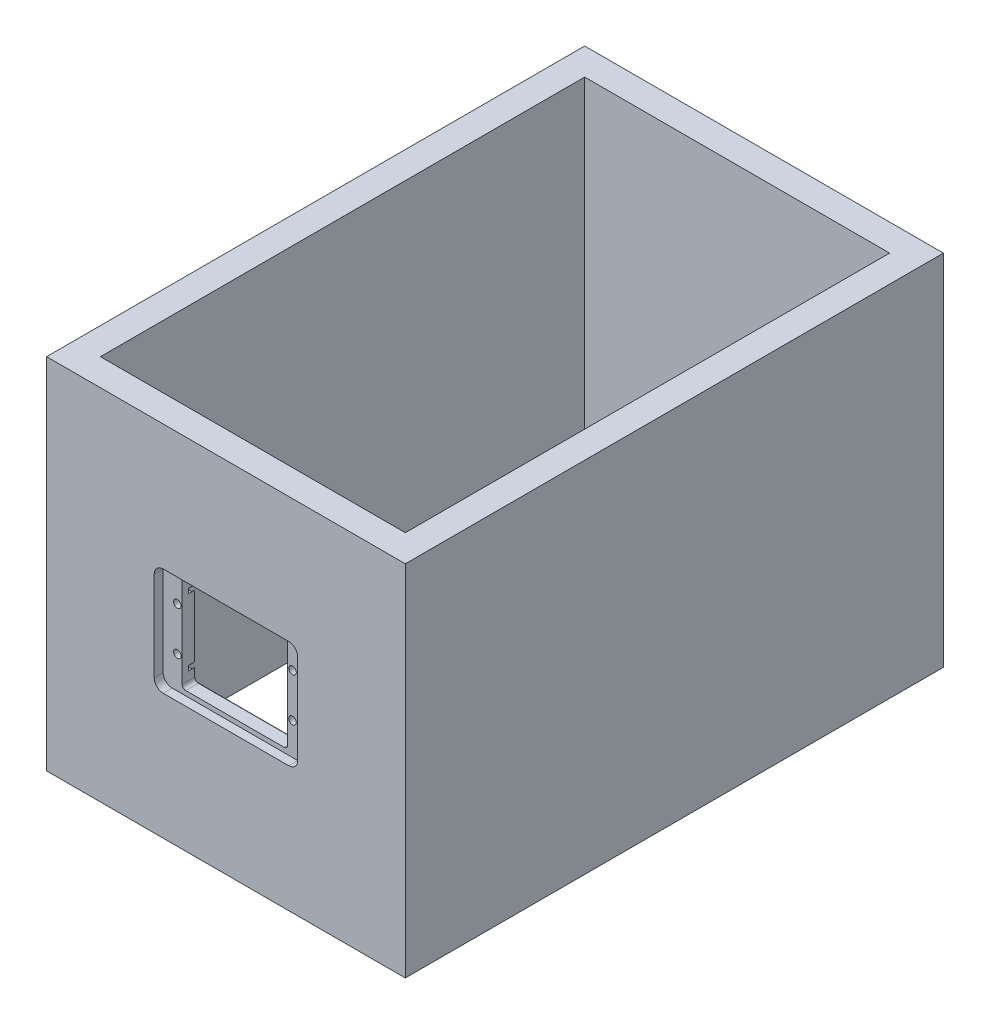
from build123d import *

# Parameters (mm, degrees)
SKETCH_1_W          = 200
SKETCH_1_H          = 200
EXTRUDE_1_DEPTH     = 300
SKETCH_2_W          = 170
SKETCH_2_H          = 270
CUT_EXTRUDE_1_DEPTH = 375.165738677
CUT_EXTRUDE_2_REACH = 333.662
SKETCH_3_R          = 7.5
CUT_EXTRUDE_3_REACH = 320.159
SKETCH_4_R          = 2.1
CUT_EXTRUDE_4_DEPTH = 5
CUT_EXTRUDE_5_DEPTH = 3
SKETCH_7_R          = 3
CUT_EXTRUDE_6_DEPTH = 3.5


with BuildPart() as part:
    # Sketch 1 → Extrude 1 (new body)
    with BuildSketch(Plane.XY):
        Rectangle(SKETCH_1_W, SKETCH_1_H)
    extrude(amount=EXTRUDE_1_DEPTH)

    # Sketch 2 → Cut-Extrude 1 (cut, through all)
    with BuildSketch(Plane.XZ.offset(100)):
        with Locations((0, 150)):
            Rectangle(SKETCH_2_W, SKETCH_2_H)
    extrude(amount=-CUT_EXTRUDE_1_DEPTH, mode=Mode.SUBTRACT)

    # Sketch 3 → Cut-Extrude 2 (cut, up to next)
    with BuildSketch(Plane(origin=(0, 0, 0), x_dir=(-1, 0, 0), z_dir=(0, 0, -1)), mode=Mode.PRIVATE) as cut_extrude_2_sk1:
        Circle(SKETCH_3_R)
    cut_extrude_2_tool1 = extrude(cut_extrude_2_sk1.sketch, amount=-CUT_EXTRUDE_2_REACH, mode=Mode.PRIVATE) & part.part
    add(cut_extrude_2_tool1.solids().sort_by_distance((0, 0, 0))[0], mode=Mode.SUBTRACT)

    # Sketch 4 → Cut-Extrude 3 (cut, up to next)
    with BuildSketch(Plane(origin=(0, 0, 285), x_dir=(-1, 0, 0), z_dir=(0, 0, -1)), mode=Mode.PRIVATE) as cut_extrude_3_sk1:
        with Locations((-32.1, 12.1)):
            Circle(SKETCH_4_R)
    cut_extrude_3_tool1 = extrude(cut_extrude_3_sk1.sketch, amount=-CUT_EXTRUDE_3_REACH, mode=Mode.PRIVATE) & part.part
    # Sketch 4 → Cut-Extrude 3 (cut, up to next)
    with BuildSketch(Plane(origin=(0, 0, 285), x_dir=(-1, 0, 0), z_dir=(0, 0, -1)), mode=Mode.PRIVATE) as cut_extrude_3_sk2:
        with Locations((32.1, 12.1)):
            Circle(SKETCH_4_R)
    cut_extrude_3_tool2 = extrude(cut_extrude_3_sk2.sketch, amount=-CUT_EXTRUDE_3_REACH, mode=Mode.PRIVATE) & part.part
    # Sketch 4 → Cut-Extrude 3 (cut, up to next)
    with BuildSketch(Plane(origin=(0, 0, 285), x_dir=(-1, 0, 0), z_dir=(0, 0, -1)), mode=Mode.PRIVATE) as cut_extrude_3_sk3:
        with Locations((32.1, -12.1)):
            Circle(SKETCH_4_R)
    cut_extrude_3_tool3 = extrude(cut_extrude_3_sk3.sketch, amount=-CUT_EXTRUDE_3_REACH, mode=Mode.PRIVATE) & part.part
    # Sketch 4 → Cut-Extrude 3 (cut, up to next)
    with BuildSketch(Plane(origin=(0, 0, 285), x_dir=(-1, 0, 0), z_dir=(0, 0, -1)), mode=Mode.PRIVATE) as cut_extrude_3_sk4:
        with Locations((-32.1, -12.1)):
            Circle(SKETCH_4_R)
    cut_extrude_3_tool4 = extrude(cut_extrude_3_sk4.sketch, amount=-CUT_EXTRUDE_3_REACH, mode=Mode.PRIVATE) & part.part
    # Sketch 4 → Cut-Extrude 3 (cut, up to next)
    with BuildSketch(Plane(origin=(0, 0, 285), x_dir=(-1, 0, 0), z_dir=(0, 0, -1)), mode=Mode.PRIVATE) as cut_extrude_3_sk5:
        with BuildLine():
            Line((27.4, 27.4), (-27.4, 27.4))
            ThreePointArc((-27.4, 27.4), (-28.814213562, 26.814213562), (-29.4, 25.4))
            Line((-29.4, 25.4), (-29.4, -25.4))
            ThreePointArc((-29.4, -25.4), (-28.814213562, -26.814213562), (-27.4, -27.4))
            Line((-27.4, -27.4), (27.4, -27.4))
            ThreePointArc((27.4, -27.4), (28.814213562, -26.814213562), (29.4, -25.4))
            Line((29.4, -25.4), (29.4, 25.4))
            ThreePointArc((29.4, 25.4), (28.814213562, 26.814213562), (27.4, 27.4))
        make_face()
    cut_extrude_3_tool5 = extrude(cut_extrude_3_sk5.sketch, amount=-CUT_EXTRUDE_3_REACH, mode=Mode.PRIVATE) & part.part
    add(cut_extrude_3_tool1.solids().sort_by_distance((32.1, 12.1, 285))[0], mode=Mode.SUBTRACT)
    add(cut_extrude_3_tool2.solids().sort_by_distance((-32.1, 12.1, 285))[0], mode=Mode.SUBTRACT)
    add(cut_extrude_3_tool3.solids().sort_by_distance((-32.1, -12.1, 285))[0], mode=Mode.SUBTRACT)
    add(cut_extrude_3_tool4.solids().sort_by_distance((32.1, -12.1, 285))[0], mode=Mode.SUBTRACT)
    add(cut_extrude_3_tool5.solids().sort_by_distance((0, 0, 285))[0], mode=Mode.SUBTRACT)

    # Sketch 5 → Cut-Extrude 4 (cut)
    with BuildSketch(Plane.XY.offset(300)):
        with BuildLine():
            Line((-35, 30), (35, 30))
            ThreePointArc((35, 30), (38.535533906, 28.535533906), (40, 25))
            Line((40, 25), (40, -25))
            ThreePointArc((40, -25), (38.535533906, -28.535533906), (35, -30))
            Line((35, -30), (-35, -30))
            ThreePointArc((-35, -30), (-38.535533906, -28.535533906), (-40, -25))
            Line((-40, -25), (-40, 25))
            ThreePointArc((-40, 25), (-38.535533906, 28.535533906), (-35, 30))
        make_face()
    extrude(amount=-CUT_EXTRUDE_4_DEPTH, mode=Mode.SUBTRACT)

    # Sketch 6 → Cut-Extrude 5 (cut)
    with BuildSketch(Plane(origin=(0, 0, 285), x_dir=(-1, 0, 0), z_dir=(0, 0, -1))):
        with BuildLine():
            Line((-33.25, 30.25), (33.25, 30.25))
            ThreePointArc((33.25, 30.25), (36.785533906, 28.785533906), (38.25, 25.25))
            Line((38.25, 25.25), (38.25, -25.25))
            ThreePointArc((38.25, -25.25), (36.785533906, -28.785533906), (33.25, -30.25))
            Line((33.25, -30.25), (-33.25, -30.25))
            ThreePointArc((-33.25, -30.25), (-36.785533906, -28.785533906), (-38.25, -25.25))
            Line((-38.25, -25.25), (-38.25, 25.25))
            ThreePointArc((-38.25, 25.25), (-36.785533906, 28.785533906), (-33.25, 30.25))
        make_face()
    extrude(amount=-CUT_EXTRUDE_5_DEPTH, mode=Mode.SUBTRACT)

    # Sketch 7 → Cut-Extrude 6 (cut)
    with BuildSketch(Plane(origin=(0, 0, 288), x_dir=(-1, 0, 0), z_dir=(0, 0, -1))):
        with BuildLine():
            ThreePointArc((-29.4, 18.092330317), (-29.175961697, 18.729179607), (-29.1, 19.4))
            ThreePointArc((-29.1, 19.4), (-29.175961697, 20.070820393), (-29.4, 20.707669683))
            Line((-29.4, 20.707669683), (-29.4, 18.092330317))
        make_face()
        with BuildLine():
            Line((-29.4, 18.092330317), (-29.4, 20.707669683))
            ThreePointArc((-29.4, 20.707669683), (-35.1, 19.4), (-29.4, 18.092330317))
        make_face()
        with BuildLine():
            ThreePointArc((35.1, -19.4), (32.770820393, -16.475961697), (29.4, -18.092330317))
            Line((29.4, -18.092330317), (29.4, -20.707669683))
            ThreePointArc((29.4, -20.707669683), (32.770820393, -22.324038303), (35.1, -19.4))
        make_face()
        with BuildLine():
            Line((29.4, -20.707669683), (29.4, -18.092330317))
            ThreePointArc((29.4, -18.092330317), (29.1, -19.4), (29.4, -20.707669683))
        make_face()
        with Locations((-32.1, -19.4)):
            Circle(SKETCH_7_R)
        with Locations((32.1, 17.9)):
            Circle(SKETCH_7_R)
    extrude(amount=-CUT_EXTRUDE_6_DEPTH, mode=Mode.SUBTRACT)


solid = part.part
